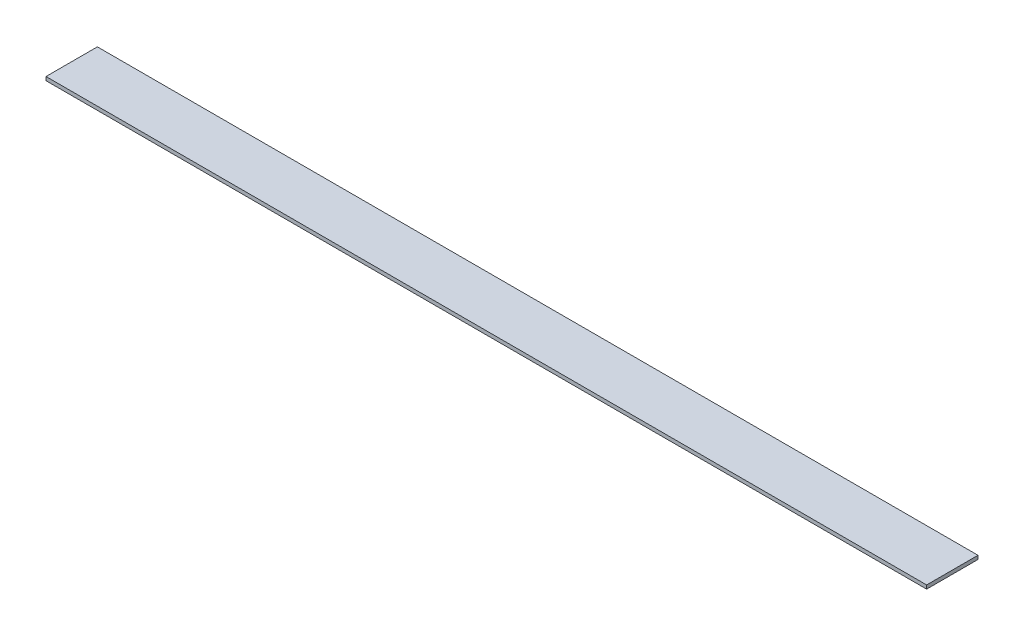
ISO-10303-21;
HEADER;
FILE_DESCRIPTION(('STEP AP214'),'2;1');
FILE_NAME('part.step','',(''),(''),'','','');
FILE_SCHEMA(('AUTOMOTIVE_DESIGN { 1 0 10303 214 1 1 1 1 }'));
ENDSEC;
DATA;
#1=APPLICATION_CONTEXT('core data for automotive mechanical design processes');
#2=APPLICATION_PROTOCOL_DEFINITION('international standard','automotive_design',2000,#1);
#3=PRODUCT_CONTEXT('',#1,'mechanical');
#4=PRODUCT('Part','Part','',(#3));
#5=PRODUCT_RELATED_PRODUCT_CATEGORY('part','',(#4));
#6=PRODUCT_DEFINITION_FORMATION('','',#4);
#7=PRODUCT_DEFINITION_CONTEXT('part definition',#1,'design');
#8=PRODUCT_DEFINITION('design','',#6,#7);
#9=PRODUCT_DEFINITION_SHAPE('','',#8);
#10=(LENGTH_UNIT() NAMED_UNIT(*) SI_UNIT(.MILLI.,.METRE.));
#11=(NAMED_UNIT(*) PLANE_ANGLE_UNIT() SI_UNIT($,.RADIAN.));
#12=(NAMED_UNIT(*) SI_UNIT($,.STERADIAN.) SOLID_ANGLE_UNIT());
#13=UNCERTAINTY_MEASURE_WITH_UNIT(LENGTH_MEASURE(1.E-05),#10,'distance_accuracy_value','');
#14=(GEOMETRIC_REPRESENTATION_CONTEXT(3) GLOBAL_UNCERTAINTY_ASSIGNED_CONTEXT((#13)) GLOBAL_UNIT_ASSIGNED_CONTEXT((#10,
#11,#12)) REPRESENTATION_CONTEXT('',''));
#15=CARTESIAN_POINT('',(0.,0.,0.));
#16=DIRECTION('',(0.,0.,1.));
#17=DIRECTION('',(1.,0.,0.));
#18=AXIS2_PLACEMENT_3D('',#15,#16,#17);
#19=CARTESIAN_POINT('',(1524.,12.7,88.9));
#20=DIRECTION('',(-1.,0.,0.));
#21=DIRECTION('',(0.,0.,1.));
#22=AXIS2_PLACEMENT_3D('',#19,#20,#21);
#23=PLANE('',#22);
#24=DIRECTION('',(0.,0.,-1.));
#25=VECTOR('',#24,1.);
#26=CARTESIAN_POINT('',(1524.,0.,88.9));
#27=LINE('',#26,#25);
#28=CARTESIAN_POINT('',(1524.,0.,88.9));
#29=VERTEX_POINT('',#28);
#30=CARTESIAN_POINT('',(1524.,0.,-88.9000000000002));
#31=VERTEX_POINT('',#30);
#32=EDGE_CURVE('E102',#29,#31,#27,.T.);
#33=ORIENTED_EDGE('',*,*,#32,.T.);
#34=DIRECTION('',(0.,-1.,0.));
#35=VECTOR('',#34,1.);
#36=CARTESIAN_POINT('',(1524.,12.7,-88.9000000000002));
#37=LINE('',#36,#35);
#38=CARTESIAN_POINT('',(1524.,12.7,-88.9000000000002));
#39=VERTEX_POINT('',#38);
#40=EDGE_CURVE('E11',#39,#31,#37,.T.);
#41=ORIENTED_EDGE('',*,*,#40,.F.);
#42=DIRECTION('',(0.,0.,-1.));
#43=VECTOR('',#42,1.);
#44=CARTESIAN_POINT('',(1524.,12.7,88.9));
#45=LINE('',#44,#43);
#46=CARTESIAN_POINT('',(1524.,12.7,88.9));
#47=VERTEX_POINT('',#46);
#48=EDGE_CURVE('E90',#47,#39,#45,.T.);
#49=ORIENTED_EDGE('',*,*,#48,.F.);
#50=DIRECTION('',(0.,-1.,0.));
#51=VECTOR('',#50,1.);
#52=CARTESIAN_POINT('',(1524.,12.7,88.9));
#53=LINE('',#52,#51);
#54=EDGE_CURVE('E98',#47,#29,#53,.T.);
#55=ORIENTED_EDGE('',*,*,#54,.T.);
#56=EDGE_LOOP('',(#33,#41,#49,#55));
#57=FACE_BOUND('',#56,.T.);
#58=ADVANCED_FACE('F39',(#57),#23,.F.);
#59=CARTESIAN_POINT('',(-1524.,12.7,-88.9000000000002));
#60=DIRECTION('',(0.,0.,1.));
#61=DIRECTION('',(1.,0.,0.));
#62=AXIS2_PLACEMENT_3D('',#59,#60,#61);
#63=PLANE('',#62);
#64=DIRECTION('',(-1.,0.,0.));
#65=VECTOR('',#64,1.);
#66=CARTESIAN_POINT('',(-1524.,0.,-88.9000000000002));
#67=LINE('',#66,#65);
#68=CARTESIAN_POINT('',(-1524.,0.,-88.9000000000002));
#69=VERTEX_POINT('',#68);
#70=EDGE_CURVE('E94',#31,#69,#67,.T.);
#71=ORIENTED_EDGE('',*,*,#70,.T.);
#72=DIRECTION('',(0.,-1.,0.));
#73=VECTOR('',#72,1.);
#74=CARTESIAN_POINT('',(-1524.,12.7,-88.9000000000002));
#75=LINE('',#74,#73);
#76=CARTESIAN_POINT('',(-1524.,12.7,-88.9000000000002));
#77=VERTEX_POINT('',#76);
#78=EDGE_CURVE('E47',#77,#69,#75,.T.);
#79=ORIENTED_EDGE('',*,*,#78,.F.);
#80=DIRECTION('',(-1.,0.,0.));
#81=VECTOR('',#80,1.);
#82=CARTESIAN_POINT('',(-1524.,12.7,-88.9000000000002));
#83=LINE('',#82,#81);
#84=EDGE_CURVE('E85',#39,#77,#83,.T.);
#85=ORIENTED_EDGE('',*,*,#84,.F.);
#86=ORIENTED_EDGE('',*,*,#40,.T.);
#87=EDGE_LOOP('',(#71,#79,#85,#86));
#88=FACE_BOUND('',#87,.T.);
#89=ADVANCED_FACE('F93',(#88),#63,.F.);
#90=CARTESIAN_POINT('',(-1524.,12.7,88.9));
#91=DIRECTION('',(1.,0.,0.));
#92=DIRECTION('',(0.,0.,-1.));
#93=AXIS2_PLACEMENT_3D('',#90,#91,#92);
#94=PLANE('',#93);
#95=DIRECTION('',(0.,0.,1.));
#96=VECTOR('',#95,1.);
#97=CARTESIAN_POINT('',(-1524.,0.,88.9));
#98=LINE('',#97,#96);
#99=CARTESIAN_POINT('',(-1524.,0.,88.9));
#100=VERTEX_POINT('',#99);
#101=EDGE_CURVE('E72',#69,#100,#98,.T.);
#102=ORIENTED_EDGE('',*,*,#101,.T.);
#103=DIRECTION('',(0.,-1.,0.));
#104=VECTOR('',#103,1.);
#105=CARTESIAN_POINT('',(-1524.,12.7,88.9));
#106=LINE('',#105,#104);
#107=CARTESIAN_POINT('',(-1524.,12.7,88.9));
#108=VERTEX_POINT('',#107);
#109=EDGE_CURVE('E95',#108,#100,#106,.T.);
#110=ORIENTED_EDGE('',*,*,#109,.F.);
#111=DIRECTION('',(0.,0.,1.));
#112=VECTOR('',#111,1.);
#113=CARTESIAN_POINT('',(-1524.,12.7,88.9));
#114=LINE('',#113,#112);
#115=EDGE_CURVE('E88',#77,#108,#114,.T.);
#116=ORIENTED_EDGE('',*,*,#115,.F.);
#117=ORIENTED_EDGE('',*,*,#78,.T.);
#118=EDGE_LOOP('',(#102,#110,#116,#117));
#119=FACE_BOUND('',#118,.T.);
#120=ADVANCED_FACE('F96',(#119),#94,.F.);
#121=CARTESIAN_POINT('',(-1524.,12.7,88.9));
#122=DIRECTION('',(0.,0.,-1.));
#123=DIRECTION('',(-1.,0.,0.));
#124=AXIS2_PLACEMENT_3D('',#121,#122,#123);
#125=PLANE('',#124);
#126=DIRECTION('',(1.,0.,0.));
#127=VECTOR('',#126,1.);
#128=CARTESIAN_POINT('',(-1524.,0.,88.9));
#129=LINE('',#128,#127);
#130=EDGE_CURVE('E78',#100,#29,#129,.T.);
#131=ORIENTED_EDGE('',*,*,#130,.T.);
#132=ORIENTED_EDGE('',*,*,#54,.F.);
#133=DIRECTION('',(1.,0.,0.));
#134=VECTOR('',#133,1.);
#135=CARTESIAN_POINT('',(-1524.,12.7,88.9));
#136=LINE('',#135,#134);
#137=EDGE_CURVE('E55',#108,#47,#136,.T.);
#138=ORIENTED_EDGE('',*,*,#137,.F.);
#139=ORIENTED_EDGE('',*,*,#109,.T.);
#140=EDGE_LOOP('',(#131,#132,#138,#139));
#141=FACE_BOUND('',#140,.T.);
#142=ADVANCED_FACE('F109',(#141),#125,.F.);
#143=CARTESIAN_POINT('',(0.,12.7,0.));
#144=DIRECTION('',(0.,-1.,0.));
#145=DIRECTION('',(0.,0.,-1.));
#146=AXIS2_PLACEMENT_3D('',#143,#144,#145);
#147=PLANE('',#146);
#148=ORIENTED_EDGE('',*,*,#48,.T.);
#149=ORIENTED_EDGE('',*,*,#84,.T.);
#150=ORIENTED_EDGE('',*,*,#115,.T.);
#151=ORIENTED_EDGE('',*,*,#137,.T.);
#152=EDGE_LOOP('',(#148,#149,#150,#151));
#153=FACE_BOUND('',#152,.T.);
#154=ADVANCED_FACE('F86',(#153),#147,.F.);
#155=CARTESIAN_POINT('',(0.,0.,0.));
#156=DIRECTION('',(0.,-1.,0.));
#157=DIRECTION('',(0.,0.,-1.));
#158=AXIS2_PLACEMENT_3D('',#155,#156,#157);
#159=PLANE('',#158);
#160=ORIENTED_EDGE('',*,*,#32,.F.);
#161=ORIENTED_EDGE('',*,*,#130,.F.);
#162=ORIENTED_EDGE('',*,*,#101,.F.);
#163=ORIENTED_EDGE('',*,*,#70,.F.);
#164=EDGE_LOOP('',(#160,#161,#162,#163));
#165=FACE_BOUND('',#164,.T.);
#166=ADVANCED_FACE('F112',(#165),#159,.T.);
#167=CLOSED_SHELL('',(#58,#89,#120,#142,#154,#166));
#168=MANIFOLD_SOLID_BREP('B2',#167);
#169=ADVANCED_BREP_SHAPE_REPRESENTATION('',(#18,#168),#14);
#170=SHAPE_DEFINITION_REPRESENTATION(#9,#169);
ENDSEC;
END-ISO-10303-21;
